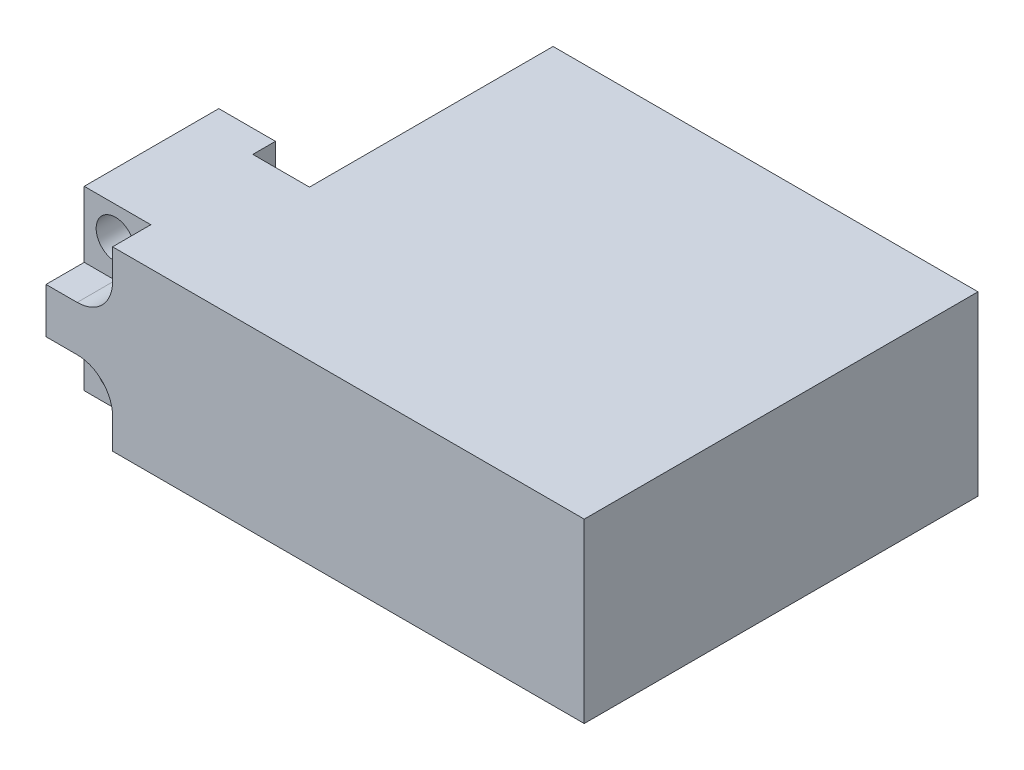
ISO-10303-21;
HEADER;
FILE_DESCRIPTION(('STEP AP214'),'2;1');
FILE_NAME('part.step','',(''),(''),'','','');
FILE_SCHEMA(('AUTOMOTIVE_DESIGN { 1 0 10303 214 1 1 1 1 }'));
ENDSEC;
DATA;
#1=APPLICATION_CONTEXT('core data for automotive mechanical design processes');
#2=APPLICATION_PROTOCOL_DEFINITION('international standard','automotive_design',2000,#1);
#3=PRODUCT_CONTEXT('',#1,'mechanical');
#4=PRODUCT('Part','Part','',(#3));
#5=PRODUCT_RELATED_PRODUCT_CATEGORY('part','',(#4));
#6=PRODUCT_DEFINITION_FORMATION('','',#4);
#7=PRODUCT_DEFINITION_CONTEXT('part definition',#1,'design');
#8=PRODUCT_DEFINITION('design','',#6,#7);
#9=PRODUCT_DEFINITION_SHAPE('','',#8);
#10=(LENGTH_UNIT() NAMED_UNIT(*) SI_UNIT(.MILLI.,.METRE.));
#11=(NAMED_UNIT(*) PLANE_ANGLE_UNIT() SI_UNIT($,.RADIAN.));
#12=(NAMED_UNIT(*) SI_UNIT($,.STERADIAN.) SOLID_ANGLE_UNIT());
#13=UNCERTAINTY_MEASURE_WITH_UNIT(LENGTH_MEASURE(1.E-05),#10,'distance_accuracy_value','');
#14=(GEOMETRIC_REPRESENTATION_CONTEXT(3) GLOBAL_UNCERTAINTY_ASSIGNED_CONTEXT((#13)) GLOBAL_UNIT_ASSIGNED_CONTEXT((#10,
#11,#12)) REPRESENTATION_CONTEXT('',''));
#15=CARTESIAN_POINT('',(0.,0.,0.));
#16=DIRECTION('',(0.,0.,1.));
#17=DIRECTION('',(1.,0.,0.));
#18=AXIS2_PLACEMENT_3D('',#15,#16,#17);
#19=CARTESIAN_POINT('',(-10.16,7.9375,0.));
#20=DIRECTION('',(0.,0.,-1.));
#21=DIRECTION('',(-1.,0.,0.));
#22=AXIS2_PLACEMENT_3D('',#19,#20,#21);
#23=PLANE('',#22);
#24=DIRECTION('',(0.,-1.,0.));
#25=VECTOR('',#24,1.);
#26=CARTESIAN_POINT('',(-4.191,-5.207,0.));
#27=LINE('',#26,#25);
#28=CARTESIAN_POINT('',(-4.191,-5.207,0.));
#29=VERTEX_POINT('',#28);
#30=CARTESIAN_POINT('',(-4.191,-7.9375,0.));
#31=VERTEX_POINT('',#30);
#32=EDGE_CURVE('E182',#29,#31,#27,.T.);
#33=ORIENTED_EDGE('',*,*,#32,.T.);
#34=DIRECTION('',(1.,0.,0.));
#35=VECTOR('',#34,1.);
#36=CARTESIAN_POINT('',(-10.16,-7.9375,0.));
#37=LINE('',#36,#35);
#38=CARTESIAN_POINT('',(38.1,-7.9375,0.));
#39=VERTEX_POINT('',#38);
#40=EDGE_CURVE('E247',#31,#39,#37,.T.);
#41=ORIENTED_EDGE('',*,*,#40,.T.);
#42=DIRECTION('',(0.,-1.,0.));
#43=VECTOR('',#42,1.);
#44=CARTESIAN_POINT('',(38.1,7.9375,0.));
#45=LINE('',#44,#43);
#46=CARTESIAN_POINT('',(38.1,7.9375,0.));
#47=VERTEX_POINT('',#46);
#48=EDGE_CURVE('E272',#47,#39,#45,.T.);
#49=ORIENTED_EDGE('',*,*,#48,.F.);
#50=DIRECTION('',(1.,0.,0.));
#51=VECTOR('',#50,1.);
#52=CARTESIAN_POINT('',(-10.16,7.9375,0.));
#53=LINE('',#52,#51);
#54=CARTESIAN_POINT('',(-4.191,7.9375,0.));
#55=VERTEX_POINT('',#54);
#56=EDGE_CURVE('E230',#55,#47,#53,.T.);
#57=ORIENTED_EDGE('',*,*,#56,.F.);
#58=DIRECTION('',(0.,1.,0.));
#59=VECTOR('',#58,1.);
#60=CARTESIAN_POINT('',(-4.191,5.207,0.));
#61=LINE('',#60,#59);
#62=CARTESIAN_POINT('',(-4.191,5.207,0.));
#63=VERTEX_POINT('',#62);
#64=EDGE_CURVE('E194',#63,#55,#61,.T.);
#65=ORIENTED_EDGE('',*,*,#64,.F.);
#66=CARTESIAN_POINT('',(-7.366,5.207,0.));
#67=DIRECTION('',(0.,0.,1.));
#68=DIRECTION('',(1.,0.,0.));
#69=AXIS2_PLACEMENT_3D('',#66,#67,#68);
#70=CIRCLE('',#69,3.175);
#71=CARTESIAN_POINT('',(-7.366,2.032,0.));
#72=VERTEX_POINT('',#71);
#73=EDGE_CURVE('E216',#72,#63,#70,.T.);
#74=ORIENTED_EDGE('',*,*,#73,.F.);
#75=DIRECTION('',(1.,0.,0.));
#76=VECTOR('',#75,1.);
#77=CARTESIAN_POINT('',(-10.16,2.032,0.));
#78=LINE('',#77,#76);
#79=CARTESIAN_POINT('',(-10.16,2.032,0.));
#80=VERTEX_POINT('',#79);
#81=EDGE_CURVE('E61',#80,#72,#78,.T.);
#82=ORIENTED_EDGE('',*,*,#81,.F.);
#83=DIRECTION('',(0.,-1.,0.));
#84=VECTOR('',#83,1.);
#85=CARTESIAN_POINT('',(-10.16,7.9375,0.));
#86=LINE('',#85,#84);
#87=CARTESIAN_POINT('',(-10.16,-2.032,0.));
#88=VERTEX_POINT('',#87);
#89=EDGE_CURVE('E275',#80,#88,#86,.T.);
#90=ORIENTED_EDGE('',*,*,#89,.T.);
#91=DIRECTION('',(1.,0.,0.));
#92=VECTOR('',#91,1.);
#93=CARTESIAN_POINT('',(-10.16,-2.032,0.));
#94=LINE('',#93,#92);
#95=CARTESIAN_POINT('',(-7.366,-2.032,0.));
#96=VERTEX_POINT('',#95);
#97=EDGE_CURVE('E169',#88,#96,#94,.T.);
#98=ORIENTED_EDGE('',*,*,#97,.T.);
#99=CARTESIAN_POINT('',(-7.366,-5.207,0.));
#100=DIRECTION('',(0.,0.,1.));
#101=DIRECTION('',(1.,0.,0.));
#102=AXIS2_PLACEMENT_3D('',#99,#100,#101);
#103=CIRCLE('',#102,3.175);
#104=EDGE_CURVE('E46',#29,#96,#103,.T.);
#105=ORIENTED_EDGE('',*,*,#104,.F.);
#106=EDGE_LOOP('',(#33,#41,#49,#57,#65,#74,#82,#90,#98,#105));
#107=FACE_BOUND('',#106,.T.);
#108=ADVANCED_FACE('F37',(#107),#23,.F.);
#109=CARTESIAN_POINT('',(-10.16,7.9375,-15.494));
#110=DIRECTION('',(1.,0.,0.));
#111=DIRECTION('',(0.,0.,-1.));
#112=AXIS2_PLACEMENT_3D('',#109,#110,#111);
#113=PLANE('',#112);
#114=DIRECTION('',(0.,0.,1.));
#115=VECTOR('',#114,1.);
#116=CARTESIAN_POINT('',(-10.16,-7.9375,-15.494));
#117=LINE('',#116,#115);
#118=CARTESIAN_POINT('',(-10.16,-7.9375,-15.494));
#119=VERTEX_POINT('',#118);
#120=CARTESIAN_POINT('',(-10.16,-7.9375,-3.429));
#121=VERTEX_POINT('',#120);
#122=EDGE_CURVE('E159',#119,#121,#117,.T.);
#123=ORIENTED_EDGE('',*,*,#122,.T.);
#124=DIRECTION('',(0.,1.,0.));
#125=VECTOR('',#124,1.);
#126=CARTESIAN_POINT('',(-10.16,7.9375,-3.429));
#127=LINE('',#126,#125);
#128=CARTESIAN_POINT('',(-10.16,-2.032,-3.429));
#129=VERTEX_POINT('',#128);
#130=EDGE_CURVE('E152',#121,#129,#127,.T.);
#131=ORIENTED_EDGE('',*,*,#130,.T.);
#132=DIRECTION('',(0.,0.,1.));
#133=VECTOR('',#132,1.);
#134=CARTESIAN_POINT('',(-10.16,-2.032,-11.8256595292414));
#135=LINE('',#134,#133);
#136=EDGE_CURVE('E156',#129,#88,#135,.T.);
#137=ORIENTED_EDGE('',*,*,#136,.T.);
#138=ORIENTED_EDGE('',*,*,#89,.F.);
#139=DIRECTION('',(0.,0.,1.));
#140=VECTOR('',#139,1.);
#141=CARTESIAN_POINT('',(-10.16,2.032,-11.8256595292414));
#142=LINE('',#141,#140);
#143=CARTESIAN_POINT('',(-10.16,2.032,-3.429));
#144=VERTEX_POINT('',#143);
#145=EDGE_CURVE('E203',#144,#80,#142,.T.);
#146=ORIENTED_EDGE('',*,*,#145,.F.);
#147=DIRECTION('',(0.,1.,0.));
#148=VECTOR('',#147,1.);
#149=CARTESIAN_POINT('',(-10.16,7.9375,-3.429));
#150=LINE('',#149,#148);
#151=CARTESIAN_POINT('',(-10.16,7.9375,-3.429));
#152=VERTEX_POINT('',#151);
#153=EDGE_CURVE('E219',#144,#152,#150,.T.);
#154=ORIENTED_EDGE('',*,*,#153,.T.);
#155=DIRECTION('',(0.,0.,1.));
#156=VECTOR('',#155,1.);
#157=CARTESIAN_POINT('',(-10.16,7.9375,-15.494));
#158=LINE('',#157,#156);
#159=CARTESIAN_POINT('',(-10.16,7.9375,-15.494));
#160=VERTEX_POINT('',#159);
#161=EDGE_CURVE('E226',#160,#152,#158,.T.);
#162=ORIENTED_EDGE('',*,*,#161,.F.);
#163=DIRECTION('',(0.,-1.,0.));
#164=VECTOR('',#163,1.);
#165=CARTESIAN_POINT('',(-10.16,7.9375,-15.494));
#166=LINE('',#165,#164);
#167=EDGE_CURVE('E277',#160,#119,#166,.T.);
#168=ORIENTED_EDGE('',*,*,#167,.T.);
#169=EDGE_LOOP('',(#123,#131,#137,#138,#146,#154,#162,#168));
#170=FACE_BOUND('',#169,.T.);
#171=ADVANCED_FACE('F154',(#170),#113,.F.);
#172=CARTESIAN_POINT('',(38.1,-7.9375,-15.494));
#173=DIRECTION('',(0.,-1.,0.));
#174=DIRECTION('',(0.,0.,-1.));
#175=AXIS2_PLACEMENT_3D('',#172,#173,#174);
#176=PLANE('',#175);
#177=DIRECTION('',(1.,0.,0.));
#178=VECTOR('',#177,1.);
#179=CARTESIAN_POINT('',(38.1,-7.9375,-3.429));
#180=LINE('',#179,#178);
#181=CARTESIAN_POINT('',(-4.191,-7.9375,-3.429));
#182=VERTEX_POINT('',#181);
#183=EDGE_CURVE('E11',#121,#182,#180,.T.);
#184=ORIENTED_EDGE('',*,*,#183,.F.);
#185=ORIENTED_EDGE('',*,*,#122,.F.);
#186=DIRECTION('',(-1.,0.,0.));
#187=VECTOR('',#186,1.);
#188=CARTESIAN_POINT('',(-10.16,-7.9375,-15.494));
#189=LINE('',#188,#187);
#190=CARTESIAN_POINT('',(-5.08,-7.9375,-15.494));
#191=VERTEX_POINT('',#190);
#192=EDGE_CURVE('E243',#191,#119,#189,.T.);
#193=ORIENTED_EDGE('',*,*,#192,.F.);
#194=DIRECTION('',(0.,0.,-1.));
#195=VECTOR('',#194,1.);
#196=CARTESIAN_POINT('',(-5.08,-7.9375,-15.494));
#197=LINE('',#196,#195);
#198=CARTESIAN_POINT('',(-5.08,-7.9375,-13.462));
#199=VERTEX_POINT('',#198);
#200=EDGE_CURVE('E227',#199,#191,#197,.T.);
#201=ORIENTED_EDGE('',*,*,#200,.F.);
#202=DIRECTION('',(-1.,0.,0.));
#203=VECTOR('',#202,1.);
#204=CARTESIAN_POINT('',(-5.08,-7.9375,-13.462));
#205=LINE('',#204,#203);
#206=CARTESIAN_POINT('',(0.,-7.9375,-13.462));
#207=VERTEX_POINT('',#206);
#208=EDGE_CURVE('E255',#207,#199,#205,.T.);
#209=ORIENTED_EDGE('',*,*,#208,.F.);
#210=DIRECTION('',(0.,0.,1.));
#211=VECTOR('',#210,1.);
#212=CARTESIAN_POINT('',(0.,-7.9375,-13.462));
#213=LINE('',#212,#211);
#214=CARTESIAN_POINT('',(0.,-7.9375,-35.306));
#215=VERTEX_POINT('',#214);
#216=EDGE_CURVE('E253',#215,#207,#213,.T.);
#217=ORIENTED_EDGE('',*,*,#216,.F.);
#218=DIRECTION('',(-1.,0.,0.));
#219=VECTOR('',#218,1.);
#220=CARTESIAN_POINT('',(0.,-7.9375,-35.306));
#221=LINE('',#220,#219);
#222=CARTESIAN_POINT('',(38.1,-7.9375,-35.306));
#223=VERTEX_POINT('',#222);
#224=EDGE_CURVE('E251',#223,#215,#221,.T.);
#225=ORIENTED_EDGE('',*,*,#224,.F.);
#226=DIRECTION('',(0.,0.,-1.));
#227=VECTOR('',#226,1.);
#228=CARTESIAN_POINT('',(38.1,-7.9375,-35.306));
#229=LINE('',#228,#227);
#230=EDGE_CURVE('E249',#39,#223,#229,.T.);
#231=ORIENTED_EDGE('',*,*,#230,.F.);
#232=ORIENTED_EDGE('',*,*,#40,.F.);
#233=DIRECTION('',(0.,0.,1.));
#234=VECTOR('',#233,1.);
#235=CARTESIAN_POINT('',(-4.191,-7.9375,-11.8256595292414));
#236=LINE('',#235,#234);
#237=EDGE_CURVE('E170',#182,#31,#236,.T.);
#238=ORIENTED_EDGE('',*,*,#237,.F.);
#239=EDGE_LOOP('',(#184,#185,#193,#201,#209,#217,#225,#231,#232,#238));
#240=FACE_BOUND('',#239,.T.);
#241=ADVANCED_FACE('F308',(#240),#176,.T.);
#242=CARTESIAN_POINT('',(-7.366,-5.207,0.));
#243=DIRECTION('',(0.,0.,1.));
#244=DIRECTION('',(1.,0.,0.));
#245=AXIS2_PLACEMENT_3D('',#242,#243,#244);
#246=CYLINDRICAL_SURFACE('',#245,3.175);
#247=DIRECTION('',(0.,0.,1.));
#248=VECTOR('',#247,1.);
#249=CARTESIAN_POINT('',(-4.191,-5.207,-11.8256595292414));
#250=LINE('',#249,#248);
#251=CARTESIAN_POINT('',(-4.191,-5.207,-3.429));
#252=VERTEX_POINT('',#251);
#253=EDGE_CURVE('E53',#252,#29,#250,.T.);
#254=ORIENTED_EDGE('',*,*,#253,.T.);
#255=ORIENTED_EDGE('',*,*,#104,.T.);
#256=DIRECTION('',(0.,0.,1.));
#257=VECTOR('',#256,1.);
#258=CARTESIAN_POINT('',(-7.366,-2.032,-11.8256595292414));
#259=LINE('',#258,#257);
#260=CARTESIAN_POINT('',(-7.366,-2.032,-3.429));
#261=VERTEX_POINT('',#260);
#262=EDGE_CURVE('E183',#261,#96,#259,.T.);
#263=ORIENTED_EDGE('',*,*,#262,.F.);
#264=CARTESIAN_POINT('',(-7.366,-5.207,-3.429));
#265=DIRECTION('',(0.,0.,1.));
#266=DIRECTION('',(1.,0.,0.));
#267=AXIS2_PLACEMENT_3D('',#264,#265,#266);
#268=CIRCLE('',#267,3.175);
#269=EDGE_CURVE('E162',#252,#261,#268,.T.);
#270=ORIENTED_EDGE('',*,*,#269,.F.);
#271=EDGE_LOOP('',(#254,#255,#263,#270));
#272=FACE_BOUND('',#271,.T.);
#273=ADVANCED_FACE('F331',(#272),#246,.F.);
#274=CARTESIAN_POINT('',(-7.366,5.207,0.));
#275=DIRECTION('',(0.,0.,1.));
#276=DIRECTION('',(1.,0.,0.));
#277=AXIS2_PLACEMENT_3D('',#274,#275,#276);
#278=CYLINDRICAL_SURFACE('',#277,3.175);
#279=ORIENTED_EDGE('',*,*,#73,.T.);
#280=DIRECTION('',(0.,0.,1.));
#281=VECTOR('',#280,1.);
#282=CARTESIAN_POINT('',(-4.191,5.207,-11.8256595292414));
#283=LINE('',#282,#281);
#284=CARTESIAN_POINT('',(-4.191,5.207,-3.429));
#285=VERTEX_POINT('',#284);
#286=EDGE_CURVE('E205',#285,#63,#283,.T.);
#287=ORIENTED_EDGE('',*,*,#286,.F.);
#288=CARTESIAN_POINT('',(-7.366,5.207,-3.429));
#289=DIRECTION('',(0.,0.,1.));
#290=DIRECTION('',(1.,0.,0.));
#291=AXIS2_PLACEMENT_3D('',#288,#289,#290);
#292=CIRCLE('',#291,3.175);
#293=CARTESIAN_POINT('',(-7.366,2.032,-3.429));
#294=VERTEX_POINT('',#293);
#295=EDGE_CURVE('E213',#294,#285,#292,.T.);
#296=ORIENTED_EDGE('',*,*,#295,.F.);
#297=DIRECTION('',(0.,0.,1.));
#298=VECTOR('',#297,1.);
#299=CARTESIAN_POINT('',(-7.366,2.032,-11.8256595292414));
#300=LINE('',#299,#298);
#301=EDGE_CURVE('E202',#294,#72,#300,.T.);
#302=ORIENTED_EDGE('',*,*,#301,.T.);
#303=EDGE_LOOP('',(#279,#287,#296,#302));
#304=FACE_BOUND('',#303,.T.);
#305=ADVANCED_FACE('F334',(#304),#278,.F.);
#306=CARTESIAN_POINT('',(-10.16,7.9375,-15.494));
#307=DIRECTION('',(0.,0.,1.));
#308=DIRECTION('',(1.,0.,0.));
#309=AXIS2_PLACEMENT_3D('',#306,#307,#308);
#310=PLANE('',#309);
#311=CARTESIAN_POINT('',(-7.366,-5.207,-15.494));
#312=DIRECTION('',(0.,0.,1.));
#313=DIRECTION('',(1.,0.,0.));
#314=AXIS2_PLACEMENT_3D('',#311,#312,#313);
#315=CIRCLE('',#314,1.7272);
#316=CARTESIAN_POINT('',(-5.63880000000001,-5.207,-15.494));
#317=VERTEX_POINT('',#316);
#318=EDGE_CURVE('E41',#317,#317,#315,.T.);
#319=ORIENTED_EDGE('',*,*,#318,.T.);
#320=EDGE_LOOP('',(#319));
#321=FACE_BOUND('',#320,.T.);
#322=CARTESIAN_POINT('',(-7.366,5.207,-15.494));
#323=DIRECTION('',(0.,0.,1.));
#324=DIRECTION('',(1.,0.,0.));
#325=AXIS2_PLACEMENT_3D('',#322,#323,#324);
#326=CIRCLE('',#325,1.7272);
#327=CARTESIAN_POINT('',(-5.63880000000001,5.207,-15.494));
#328=VERTEX_POINT('',#327);
#329=EDGE_CURVE('E222',#328,#328,#326,.T.);
#330=ORIENTED_EDGE('',*,*,#329,.T.);
#331=EDGE_LOOP('',(#330));
#332=FACE_BOUND('',#331,.T.);
#333=ORIENTED_EDGE('',*,*,#192,.T.);
#334=ORIENTED_EDGE('',*,*,#167,.F.);
#335=DIRECTION('',(-1.,0.,0.));
#336=VECTOR('',#335,1.);
#337=CARTESIAN_POINT('',(-10.16,7.9375,-15.494));
#338=LINE('',#337,#336);
#339=CARTESIAN_POINT('',(-5.08,7.9375,-15.494));
#340=VERTEX_POINT('',#339);
#341=EDGE_CURVE('E223',#340,#160,#338,.T.);
#342=ORIENTED_EDGE('',*,*,#341,.F.);
#343=DIRECTION('',(0.,-1.,0.));
#344=VECTOR('',#343,1.);
#345=CARTESIAN_POINT('',(-5.08,7.9375,-15.494));
#346=LINE('',#345,#344);
#347=EDGE_CURVE('E242',#340,#191,#346,.T.);
#348=ORIENTED_EDGE('',*,*,#347,.T.);
#349=EDGE_LOOP('',(#333,#334,#342,#348));
#350=FACE_BOUND('',#349,.T.);
#351=ADVANCED_FACE('F39',(#321,#332,#350),#310,.F.);
#352=CARTESIAN_POINT('',(38.1,7.9375,-35.306));
#353=DIRECTION('',(-1.,0.,0.));
#354=DIRECTION('',(0.,0.,1.));
#355=AXIS2_PLACEMENT_3D('',#352,#353,#354);
#356=PLANE('',#355);
#357=ORIENTED_EDGE('',*,*,#230,.T.);
#358=DIRECTION('',(0.,-1.,0.));
#359=VECTOR('',#358,1.);
#360=CARTESIAN_POINT('',(38.1,7.9375,-35.306));
#361=LINE('',#360,#359);
#362=CARTESIAN_POINT('',(38.1,7.9375,-35.306));
#363=VERTEX_POINT('',#362);
#364=EDGE_CURVE('E269',#363,#223,#361,.T.);
#365=ORIENTED_EDGE('',*,*,#364,.F.);
#366=DIRECTION('',(0.,0.,-1.));
#367=VECTOR('',#366,1.);
#368=CARTESIAN_POINT('',(38.1,7.9375,-35.306));
#369=LINE('',#368,#367);
#370=EDGE_CURVE('E232',#47,#363,#369,.T.);
#371=ORIENTED_EDGE('',*,*,#370,.F.);
#372=ORIENTED_EDGE('',*,*,#48,.T.);
#373=EDGE_LOOP('',(#357,#365,#371,#372));
#374=FACE_BOUND('',#373,.T.);
#375=ADVANCED_FACE('F311',(#374),#356,.F.);
#376=CARTESIAN_POINT('',(0.,7.9375,-35.306));
#377=DIRECTION('',(0.,0.,1.));
#378=DIRECTION('',(1.,0.,0.));
#379=AXIS2_PLACEMENT_3D('',#376,#377,#378);
#380=PLANE('',#379);
#381=ORIENTED_EDGE('',*,*,#224,.T.);
#382=DIRECTION('',(0.,-1.,0.));
#383=VECTOR('',#382,1.);
#384=CARTESIAN_POINT('',(0.,7.9375,-35.306));
#385=LINE('',#384,#383);
#386=CARTESIAN_POINT('',(0.,7.9375,-35.306));
#387=VERTEX_POINT('',#386);
#388=EDGE_CURVE('E266',#387,#215,#385,.T.);
#389=ORIENTED_EDGE('',*,*,#388,.F.);
#390=DIRECTION('',(-1.,0.,0.));
#391=VECTOR('',#390,1.);
#392=CARTESIAN_POINT('',(0.,7.9375,-35.306));
#393=LINE('',#392,#391);
#394=EDGE_CURVE('E234',#363,#387,#393,.T.);
#395=ORIENTED_EDGE('',*,*,#394,.F.);
#396=ORIENTED_EDGE('',*,*,#364,.T.);
#397=EDGE_LOOP('',(#381,#389,#395,#396));
#398=FACE_BOUND('',#397,.T.);
#399=ADVANCED_FACE('F314',(#398),#380,.F.);
#400=CARTESIAN_POINT('',(0.,7.9375,-13.462));
#401=DIRECTION('',(1.,0.,0.));
#402=DIRECTION('',(0.,0.,-1.));
#403=AXIS2_PLACEMENT_3D('',#400,#401,#402);
#404=PLANE('',#403);
#405=ORIENTED_EDGE('',*,*,#216,.T.);
#406=DIRECTION('',(0.,-1.,0.));
#407=VECTOR('',#406,1.);
#408=CARTESIAN_POINT('',(0.,7.9375,-13.462));
#409=LINE('',#408,#407);
#410=CARTESIAN_POINT('',(0.,7.9375,-13.462));
#411=VERTEX_POINT('',#410);
#412=EDGE_CURVE('E263',#411,#207,#409,.T.);
#413=ORIENTED_EDGE('',*,*,#412,.F.);
#414=DIRECTION('',(0.,0.,1.));
#415=VECTOR('',#414,1.);
#416=CARTESIAN_POINT('',(0.,7.9375,-13.462));
#417=LINE('',#416,#415);
#418=EDGE_CURVE('E236',#387,#411,#417,.T.);
#419=ORIENTED_EDGE('',*,*,#418,.F.);
#420=ORIENTED_EDGE('',*,*,#388,.T.);
#421=EDGE_LOOP('',(#405,#413,#419,#420));
#422=FACE_BOUND('',#421,.T.);
#423=ADVANCED_FACE('F318',(#422),#404,.F.);
#424=CARTESIAN_POINT('',(-5.08,7.9375,-13.462));
#425=DIRECTION('',(0.,0.,1.));
#426=DIRECTION('',(1.,0.,0.));
#427=AXIS2_PLACEMENT_3D('',#424,#425,#426);
#428=PLANE('',#427);
#429=ORIENTED_EDGE('',*,*,#208,.T.);
#430=DIRECTION('',(0.,-1.,0.));
#431=VECTOR('',#430,1.);
#432=CARTESIAN_POINT('',(-5.08,7.9375,-13.462));
#433=LINE('',#432,#431);
#434=CARTESIAN_POINT('',(-5.08,7.9375,-13.462));
#435=VERTEX_POINT('',#434);
#436=EDGE_CURVE('E260',#435,#199,#433,.T.);
#437=ORIENTED_EDGE('',*,*,#436,.F.);
#438=DIRECTION('',(-1.,0.,0.));
#439=VECTOR('',#438,1.);
#440=CARTESIAN_POINT('',(-5.08,7.9375,-13.462));
#441=LINE('',#440,#439);
#442=EDGE_CURVE('E238',#411,#435,#441,.T.);
#443=ORIENTED_EDGE('',*,*,#442,.F.);
#444=ORIENTED_EDGE('',*,*,#412,.T.);
#445=EDGE_LOOP('',(#429,#437,#443,#444));
#446=FACE_BOUND('',#445,.T.);
#447=ADVANCED_FACE('F322',(#446),#428,.F.);
#448=CARTESIAN_POINT('',(-5.08,7.9375,-15.494));
#449=DIRECTION('',(-1.,0.,0.));
#450=DIRECTION('',(0.,0.,1.));
#451=AXIS2_PLACEMENT_3D('',#448,#449,#450);
#452=PLANE('',#451);
#453=ORIENTED_EDGE('',*,*,#200,.T.);
#454=ORIENTED_EDGE('',*,*,#347,.F.);
#455=DIRECTION('',(0.,0.,-1.));
#456=VECTOR('',#455,1.);
#457=CARTESIAN_POINT('',(-5.08,7.9375,-15.494));
#458=LINE('',#457,#456);
#459=EDGE_CURVE('E240',#435,#340,#458,.T.);
#460=ORIENTED_EDGE('',*,*,#459,.F.);
#461=ORIENTED_EDGE('',*,*,#436,.T.);
#462=EDGE_LOOP('',(#453,#454,#460,#461));
#463=FACE_BOUND('',#462,.T.);
#464=ADVANCED_FACE('F298',(#463),#452,.F.);
#465=CARTESIAN_POINT('',(38.1,7.9375,-15.494));
#466=DIRECTION('',(0.,-1.,0.));
#467=DIRECTION('',(0.,0.,-1.));
#468=AXIS2_PLACEMENT_3D('',#465,#466,#467);
#469=PLANE('',#468);
#470=ORIENTED_EDGE('',*,*,#161,.T.);
#471=DIRECTION('',(1.,0.,0.));
#472=VECTOR('',#471,1.);
#473=CARTESIAN_POINT('',(38.1,7.9375,-3.429));
#474=LINE('',#473,#472);
#475=CARTESIAN_POINT('',(-4.191,7.9375,-3.429));
#476=VERTEX_POINT('',#475);
#477=EDGE_CURVE('E190',#152,#476,#474,.T.);
#478=ORIENTED_EDGE('',*,*,#477,.T.);
#479=DIRECTION('',(0.,0.,1.));
#480=VECTOR('',#479,1.);
#481=CARTESIAN_POINT('',(-4.191,7.9375,-11.8256595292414));
#482=LINE('',#481,#480);
#483=EDGE_CURVE('E198',#476,#55,#482,.T.);
#484=ORIENTED_EDGE('',*,*,#483,.T.);
#485=ORIENTED_EDGE('',*,*,#56,.T.);
#486=ORIENTED_EDGE('',*,*,#370,.T.);
#487=ORIENTED_EDGE('',*,*,#394,.T.);
#488=ORIENTED_EDGE('',*,*,#418,.T.);
#489=ORIENTED_EDGE('',*,*,#442,.T.);
#490=ORIENTED_EDGE('',*,*,#459,.T.);
#491=ORIENTED_EDGE('',*,*,#341,.T.);
#492=EDGE_LOOP('',(#470,#478,#484,#485,#486,#487,#488,#489,#490,#491));
#493=FACE_BOUND('',#492,.T.);
#494=ADVANCED_FACE('F288',(#493),#469,.F.);
#495=CARTESIAN_POINT('',(-7.366,5.207,0.));
#496=DIRECTION('',(0.,0.,1.));
#497=DIRECTION('',(1.,0.,0.));
#498=AXIS2_PLACEMENT_3D('',#495,#496,#497);
#499=CYLINDRICAL_SURFACE('',#498,1.7272);
#500=CARTESIAN_POINT('',(-7.366,5.207,-3.429));
#501=DIRECTION('',(0.,0.,1.));
#502=DIRECTION('',(1.,0.,0.));
#503=AXIS2_PLACEMENT_3D('',#500,#501,#502);
#504=CIRCLE('',#503,1.7272);
#505=CARTESIAN_POINT('',(-5.6388,5.207,-3.429));
#506=VERTEX_POINT('',#505);
#507=EDGE_CURVE('E210',#506,#506,#504,.T.);
#508=ORIENTED_EDGE('',*,*,#507,.T.);
#509=EDGE_LOOP('',(#508));
#510=FACE_BOUND('',#509,.T.);
#511=ORIENTED_EDGE('',*,*,#329,.F.);
#512=EDGE_LOOP('',(#511));
#513=FACE_BOUND('',#512,.T.);
#514=ADVANCED_FACE('F285',(#510,#513),#499,.F.);
#515=CARTESIAN_POINT('',(-5.6388,5.207,-3.429));
#516=DIRECTION('',(0.,0.,-1.));
#517=DIRECTION('',(-1.,0.,0.));
#518=AXIS2_PLACEMENT_3D('',#515,#516,#517);
#519=PLANE('',#518);
#520=ORIENTED_EDGE('',*,*,#507,.F.);
#521=EDGE_LOOP('',(#520));
#522=FACE_BOUND('',#521,.T.);
#523=ORIENTED_EDGE('',*,*,#153,.F.);
#524=DIRECTION('',(1.,0.,0.));
#525=VECTOR('',#524,1.);
#526=CARTESIAN_POINT('',(-10.16,2.032,-3.429));
#527=LINE('',#526,#525);
#528=EDGE_CURVE('E199',#144,#294,#527,.T.);
#529=ORIENTED_EDGE('',*,*,#528,.T.);
#530=ORIENTED_EDGE('',*,*,#295,.T.);
#531=DIRECTION('',(0.,1.,0.));
#532=VECTOR('',#531,1.);
#533=CARTESIAN_POINT('',(-4.191,5.207,-3.429));
#534=LINE('',#533,#532);
#535=EDGE_CURVE('E193',#285,#476,#534,.T.);
#536=ORIENTED_EDGE('',*,*,#535,.T.);
#537=ORIENTED_EDGE('',*,*,#477,.F.);
#538=EDGE_LOOP('',(#523,#529,#530,#536,#537));
#539=FACE_BOUND('',#538,.T.);
#540=ADVANCED_FACE('F287',(#522,#539),#519,.F.);
#541=CARTESIAN_POINT('',(-10.16,2.032,-11.8256595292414));
#542=DIRECTION('',(0.,-1.,0.));
#543=DIRECTION('',(0.,0.,-1.));
#544=AXIS2_PLACEMENT_3D('',#541,#542,#543);
#545=PLANE('',#544);
#546=ORIENTED_EDGE('',*,*,#145,.T.);
#547=ORIENTED_EDGE('',*,*,#81,.T.);
#548=ORIENTED_EDGE('',*,*,#301,.F.);
#549=ORIENTED_EDGE('',*,*,#528,.F.);
#550=EDGE_LOOP('',(#546,#547,#548,#549));
#551=FACE_BOUND('',#550,.T.);
#552=ADVANCED_FACE('F295',(#551),#545,.F.);
#553=CARTESIAN_POINT('',(-4.191,5.207,-11.8256595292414));
#554=DIRECTION('',(1.,0.,0.));
#555=DIRECTION('',(0.,0.,-1.));
#556=AXIS2_PLACEMENT_3D('',#553,#554,#555);
#557=PLANE('',#556);
#558=ORIENTED_EDGE('',*,*,#286,.T.);
#559=ORIENTED_EDGE('',*,*,#64,.T.);
#560=ORIENTED_EDGE('',*,*,#483,.F.);
#561=ORIENTED_EDGE('',*,*,#535,.F.);
#562=EDGE_LOOP('',(#558,#559,#560,#561));
#563=FACE_BOUND('',#562,.T.);
#564=ADVANCED_FACE('F352',(#563),#557,.F.);
#565=CARTESIAN_POINT('',(-7.366,-5.207,0.));
#566=DIRECTION('',(0.,0.,1.));
#567=DIRECTION('',(1.,0.,0.));
#568=AXIS2_PLACEMENT_3D('',#565,#566,#567);
#569=CYLINDRICAL_SURFACE('',#568,1.7272);
#570=CARTESIAN_POINT('',(-7.366,-5.207,-3.429));
#571=DIRECTION('',(0.,0.,1.));
#572=DIRECTION('',(1.,0.,0.));
#573=AXIS2_PLACEMENT_3D('',#570,#571,#572);
#574=CIRCLE('',#573,1.7272);
#575=CARTESIAN_POINT('',(-5.6388,-5.207,-3.429));
#576=VERTEX_POINT('',#575);
#577=EDGE_CURVE('E177',#576,#576,#574,.T.);
#578=ORIENTED_EDGE('',*,*,#577,.T.);
#579=EDGE_LOOP('',(#578));
#580=FACE_BOUND('',#579,.T.);
#581=ORIENTED_EDGE('',*,*,#318,.F.);
#582=EDGE_LOOP('',(#581));
#583=FACE_BOUND('',#582,.T.);
#584=ADVANCED_FACE('F361',(#580,#583),#569,.F.);
#585=CARTESIAN_POINT('',(-5.6388,-5.207,-3.429));
#586=DIRECTION('',(0.,0.,-1.));
#587=DIRECTION('',(-1.,0.,0.));
#588=AXIS2_PLACEMENT_3D('',#585,#586,#587);
#589=PLANE('',#588);
#590=ORIENTED_EDGE('',*,*,#577,.F.);
#591=EDGE_LOOP('',(#590));
#592=FACE_BOUND('',#591,.T.);
#593=ORIENTED_EDGE('',*,*,#130,.F.);
#594=ORIENTED_EDGE('',*,*,#183,.T.);
#595=DIRECTION('',(0.,-1.,0.));
#596=VECTOR('',#595,1.);
#597=CARTESIAN_POINT('',(-4.191,-5.207,-3.429));
#598=LINE('',#597,#596);
#599=EDGE_CURVE('E175',#252,#182,#598,.T.);
#600=ORIENTED_EDGE('',*,*,#599,.F.);
#601=ORIENTED_EDGE('',*,*,#269,.T.);
#602=DIRECTION('',(1.,0.,0.));
#603=VECTOR('',#602,1.);
#604=CARTESIAN_POINT('',(-10.16,-2.032,-3.429));
#605=LINE('',#604,#603);
#606=EDGE_CURVE('E166',#129,#261,#605,.T.);
#607=ORIENTED_EDGE('',*,*,#606,.F.);
#608=EDGE_LOOP('',(#593,#594,#600,#601,#607));
#609=FACE_BOUND('',#608,.T.);
#610=ADVANCED_FACE('F173',(#592,#609),#589,.F.);
#611=CARTESIAN_POINT('',(-10.16,-2.032,-11.8256595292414));
#612=DIRECTION('',(0.,-1.,0.));
#613=DIRECTION('',(0.,0.,-1.));
#614=AXIS2_PLACEMENT_3D('',#611,#612,#613);
#615=PLANE('',#614);
#616=ORIENTED_EDGE('',*,*,#606,.T.);
#617=ORIENTED_EDGE('',*,*,#262,.T.);
#618=ORIENTED_EDGE('',*,*,#97,.F.);
#619=ORIENTED_EDGE('',*,*,#136,.F.);
#620=EDGE_LOOP('',(#616,#617,#618,#619));
#621=FACE_BOUND('',#620,.T.);
#622=ADVANCED_FACE('F165',(#621),#615,.T.);
#623=CARTESIAN_POINT('',(-4.191,-5.207,-11.8256595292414));
#624=DIRECTION('',(-1.,0.,0.));
#625=DIRECTION('',(0.,0.,1.));
#626=AXIS2_PLACEMENT_3D('',#623,#624,#625);
#627=PLANE('',#626);
#628=ORIENTED_EDGE('',*,*,#599,.T.);
#629=ORIENTED_EDGE('',*,*,#237,.T.);
#630=ORIENTED_EDGE('',*,*,#32,.F.);
#631=ORIENTED_EDGE('',*,*,#253,.F.);
#632=EDGE_LOOP('',(#628,#629,#630,#631));
#633=FACE_BOUND('',#632,.T.);
#634=ADVANCED_FACE('F369',(#633),#627,.T.);
#635=CLOSED_SHELL('',(#108,#171,#241,#273,#305,#351,#375,#399,#423,#447,#464,#494,#514,#540,
#552,#564,#584,#610,#622,#634));
#636=MANIFOLD_SOLID_BREP('B2',#635);
#637=ADVANCED_BREP_SHAPE_REPRESENTATION('',(#18,#636),#14);
#638=SHAPE_DEFINITION_REPRESENTATION(#9,#637);
ENDSEC;
END-ISO-10303-21;
